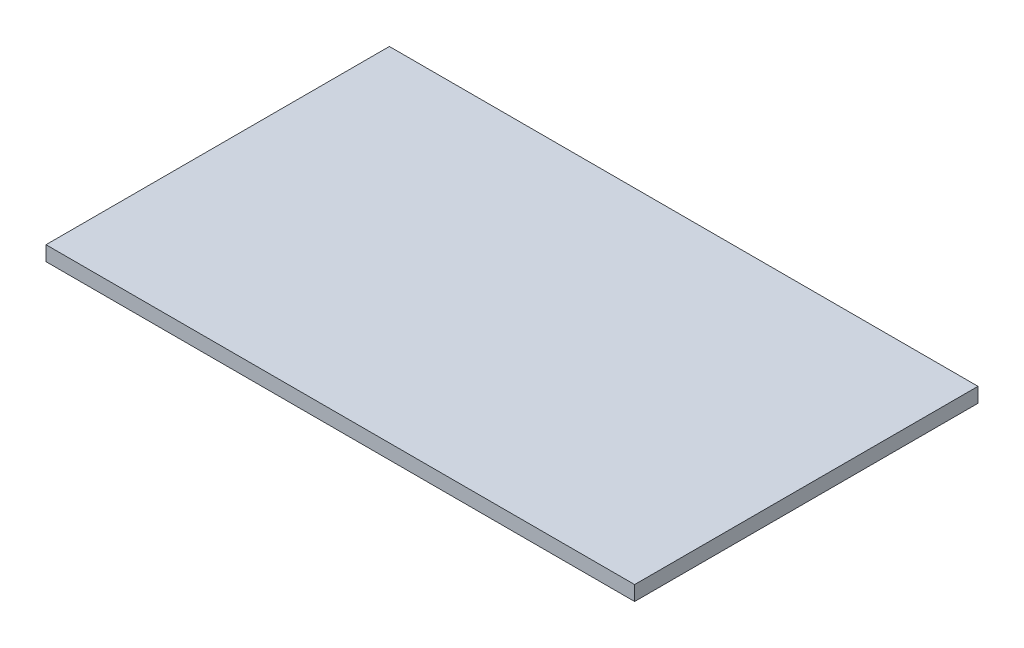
ISO-10303-21;
HEADER;
FILE_DESCRIPTION(('STEP AP214'),'2;1');
FILE_NAME('part.step','',(''),(''),'','','');
FILE_SCHEMA(('AUTOMOTIVE_DESIGN { 1 0 10303 214 1 1 1 1 }'));
ENDSEC;
DATA;
#1=APPLICATION_CONTEXT('core data for automotive mechanical design processes');
#2=APPLICATION_PROTOCOL_DEFINITION('international standard','automotive_design',2000,#1);
#3=PRODUCT_CONTEXT('',#1,'mechanical');
#4=PRODUCT('Part','Part','',(#3));
#5=PRODUCT_RELATED_PRODUCT_CATEGORY('part','',(#4));
#6=PRODUCT_DEFINITION_FORMATION('','',#4);
#7=PRODUCT_DEFINITION_CONTEXT('part definition',#1,'design');
#8=PRODUCT_DEFINITION('design','',#6,#7);
#9=PRODUCT_DEFINITION_SHAPE('','',#8);
#10=(LENGTH_UNIT() NAMED_UNIT(*) SI_UNIT(.MILLI.,.METRE.));
#11=(NAMED_UNIT(*) PLANE_ANGLE_UNIT() SI_UNIT($,.RADIAN.));
#12=(NAMED_UNIT(*) SI_UNIT($,.STERADIAN.) SOLID_ANGLE_UNIT());
#13=UNCERTAINTY_MEASURE_WITH_UNIT(LENGTH_MEASURE(1.E-05),#10,'distance_accuracy_value','');
#14=(GEOMETRIC_REPRESENTATION_CONTEXT(3) GLOBAL_UNCERTAINTY_ASSIGNED_CONTEXT((#13)) GLOBAL_UNIT_ASSIGNED_CONTEXT((#10,
#11,#12)) REPRESENTATION_CONTEXT('',''));
#15=CARTESIAN_POINT('',(0.,0.,0.));
#16=DIRECTION('',(0.,0.,1.));
#17=DIRECTION('',(1.,0.,0.));
#18=AXIS2_PLACEMENT_3D('',#15,#16,#17);
#19=CARTESIAN_POINT('',(0.,30.,0.));
#20=DIRECTION('',(1.,0.,0.));
#21=DIRECTION('',(0.,0.,-1.));
#22=AXIS2_PLACEMENT_3D('',#19,#20,#21);
#23=PLANE('',#22);
#24=DIRECTION('',(0.,0.,1.));
#25=VECTOR('',#24,1.);
#26=CARTESIAN_POINT('',(0.,0.,0.));
#27=LINE('',#26,#25);
#28=CARTESIAN_POINT('',(0.,0.,-700.));
#29=VERTEX_POINT('',#28);
#30=CARTESIAN_POINT('',(0.,0.,0.));
#31=VERTEX_POINT('',#30);
#32=EDGE_CURVE('E70',#29,#31,#27,.T.);
#33=ORIENTED_EDGE('',*,*,#32,.T.);
#34=DIRECTION('',(0.,-1.,0.));
#35=VECTOR('',#34,1.);
#36=CARTESIAN_POINT('',(0.,30.,0.));
#37=LINE('',#36,#35);
#38=CARTESIAN_POINT('',(0.,30.,0.));
#39=VERTEX_POINT('',#38);
#40=EDGE_CURVE('E11',#39,#31,#37,.T.);
#41=ORIENTED_EDGE('',*,*,#40,.F.);
#42=DIRECTION('',(0.,0.,1.));
#43=VECTOR('',#42,1.);
#44=CARTESIAN_POINT('',(0.,30.,0.));
#45=LINE('',#44,#43);
#46=CARTESIAN_POINT('',(0.,30.,-700.));
#47=VERTEX_POINT('',#46);
#48=EDGE_CURVE('E88',#47,#39,#45,.T.);
#49=ORIENTED_EDGE('',*,*,#48,.F.);
#50=DIRECTION('',(0.,-1.,0.));
#51=VECTOR('',#50,1.);
#52=CARTESIAN_POINT('',(0.,30.,-700.));
#53=LINE('',#52,#51);
#54=EDGE_CURVE('E82',#47,#29,#53,.T.);
#55=ORIENTED_EDGE('',*,*,#54,.T.);
#56=EDGE_LOOP('',(#33,#41,#49,#55));
#57=FACE_BOUND('',#56,.T.);
#58=ADVANCED_FACE('F26',(#57),#23,.F.);
#59=CARTESIAN_POINT('',(0.,30.,0.));
#60=DIRECTION('',(0.,0.,-1.));
#61=DIRECTION('',(-1.,0.,0.));
#62=AXIS2_PLACEMENT_3D('',#59,#60,#61);
#63=PLANE('',#62);
#64=DIRECTION('',(1.,0.,0.));
#65=VECTOR('',#64,1.);
#66=CARTESIAN_POINT('',(0.,0.,0.));
#67=LINE('',#66,#65);
#68=CARTESIAN_POINT('',(1200.,0.,0.));
#69=VERTEX_POINT('',#68);
#70=EDGE_CURVE('E66',#31,#69,#67,.T.);
#71=ORIENTED_EDGE('',*,*,#70,.T.);
#72=DIRECTION('',(0.,-1.,0.));
#73=VECTOR('',#72,1.);
#74=CARTESIAN_POINT('',(1200.,30.,0.));
#75=LINE('',#74,#73);
#76=CARTESIAN_POINT('',(1200.,30.,0.));
#77=VERTEX_POINT('',#76);
#78=EDGE_CURVE('E33',#77,#69,#75,.T.);
#79=ORIENTED_EDGE('',*,*,#78,.F.);
#80=DIRECTION('',(1.,0.,0.));
#81=VECTOR('',#80,1.);
#82=CARTESIAN_POINT('',(0.,30.,0.));
#83=LINE('',#82,#81);
#84=EDGE_CURVE('E78',#39,#77,#83,.T.);
#85=ORIENTED_EDGE('',*,*,#84,.F.);
#86=ORIENTED_EDGE('',*,*,#40,.T.);
#87=EDGE_LOOP('',(#71,#79,#85,#86));
#88=FACE_BOUND('',#87,.T.);
#89=ADVANCED_FACE('F77',(#88),#63,.F.);
#90=CARTESIAN_POINT('',(1200.,30.,0.));
#91=DIRECTION('',(-1.,0.,0.));
#92=DIRECTION('',(0.,0.,1.));
#93=AXIS2_PLACEMENT_3D('',#90,#91,#92);
#94=PLANE('',#93);
#95=DIRECTION('',(0.,0.,-1.));
#96=VECTOR('',#95,1.);
#97=CARTESIAN_POINT('',(1200.,0.,0.));
#98=LINE('',#97,#96);
#99=CARTESIAN_POINT('',(1200.,0.,-700.));
#100=VERTEX_POINT('',#99);
#101=EDGE_CURVE('E71',#69,#100,#98,.T.);
#102=ORIENTED_EDGE('',*,*,#101,.T.);
#103=DIRECTION('',(0.,-1.,0.));
#104=VECTOR('',#103,1.);
#105=CARTESIAN_POINT('',(1200.,30.,-700.));
#106=LINE('',#105,#104);
#107=CARTESIAN_POINT('',(1200.,30.,-700.));
#108=VERTEX_POINT('',#107);
#109=EDGE_CURVE('E94',#108,#100,#106,.T.);
#110=ORIENTED_EDGE('',*,*,#109,.F.);
#111=DIRECTION('',(0.,0.,-1.));
#112=VECTOR('',#111,1.);
#113=CARTESIAN_POINT('',(1200.,30.,0.));
#114=LINE('',#113,#112);
#115=EDGE_CURVE('E45',#77,#108,#114,.T.);
#116=ORIENTED_EDGE('',*,*,#115,.F.);
#117=ORIENTED_EDGE('',*,*,#78,.T.);
#118=EDGE_LOOP('',(#102,#110,#116,#117));
#119=FACE_BOUND('',#118,.T.);
#120=ADVANCED_FACE('F97',(#119),#94,.F.);
#121=CARTESIAN_POINT('',(0.,30.,-700.));
#122=DIRECTION('',(0.,0.,1.));
#123=DIRECTION('',(1.,0.,0.));
#124=AXIS2_PLACEMENT_3D('',#121,#122,#123);
#125=PLANE('',#124);
#126=DIRECTION('',(-1.,0.,0.));
#127=VECTOR('',#126,1.);
#128=CARTESIAN_POINT('',(0.,0.,-700.));
#129=LINE('',#128,#127);
#130=EDGE_CURVE('E86',#100,#29,#129,.T.);
#131=ORIENTED_EDGE('',*,*,#130,.T.);
#132=ORIENTED_EDGE('',*,*,#54,.F.);
#133=DIRECTION('',(-1.,0.,0.));
#134=VECTOR('',#133,1.);
#135=CARTESIAN_POINT('',(0.,30.,-700.));
#136=LINE('',#135,#134);
#137=EDGE_CURVE('E40',#108,#47,#136,.T.);
#138=ORIENTED_EDGE('',*,*,#137,.F.);
#139=ORIENTED_EDGE('',*,*,#109,.T.);
#140=EDGE_LOOP('',(#131,#132,#138,#139));
#141=FACE_BOUND('',#140,.T.);
#142=ADVANCED_FACE('F99',(#141),#125,.F.);
#143=CARTESIAN_POINT('',(0.,30.,-700.));
#144=DIRECTION('',(0.,-1.,0.));
#145=DIRECTION('',(0.,0.,-1.));
#146=AXIS2_PLACEMENT_3D('',#143,#144,#145);
#147=PLANE('',#146);
#148=ORIENTED_EDGE('',*,*,#48,.T.);
#149=ORIENTED_EDGE('',*,*,#84,.T.);
#150=ORIENTED_EDGE('',*,*,#115,.T.);
#151=ORIENTED_EDGE('',*,*,#137,.T.);
#152=EDGE_LOOP('',(#148,#149,#150,#151));
#153=FACE_BOUND('',#152,.T.);
#154=ADVANCED_FACE('F100',(#153),#147,.F.);
#155=CARTESIAN_POINT('',(0.,0.,-700.));
#156=DIRECTION('',(0.,-1.,0.));
#157=DIRECTION('',(0.,0.,-1.));
#158=AXIS2_PLACEMENT_3D('',#155,#156,#157);
#159=PLANE('',#158);
#160=ORIENTED_EDGE('',*,*,#32,.F.);
#161=ORIENTED_EDGE('',*,*,#130,.F.);
#162=ORIENTED_EDGE('',*,*,#101,.F.);
#163=ORIENTED_EDGE('',*,*,#70,.F.);
#164=EDGE_LOOP('',(#160,#161,#162,#163));
#165=FACE_BOUND('',#164,.T.);
#166=ADVANCED_FACE('F67',(#165),#159,.T.);
#167=CLOSED_SHELL('',(#58,#89,#120,#142,#154,#166));
#168=MANIFOLD_SOLID_BREP('B2',#167);
#169=ADVANCED_BREP_SHAPE_REPRESENTATION('',(#18,#168),#14);
#170=SHAPE_DEFINITION_REPRESENTATION(#9,#169);
ENDSEC;
END-ISO-10303-21;
